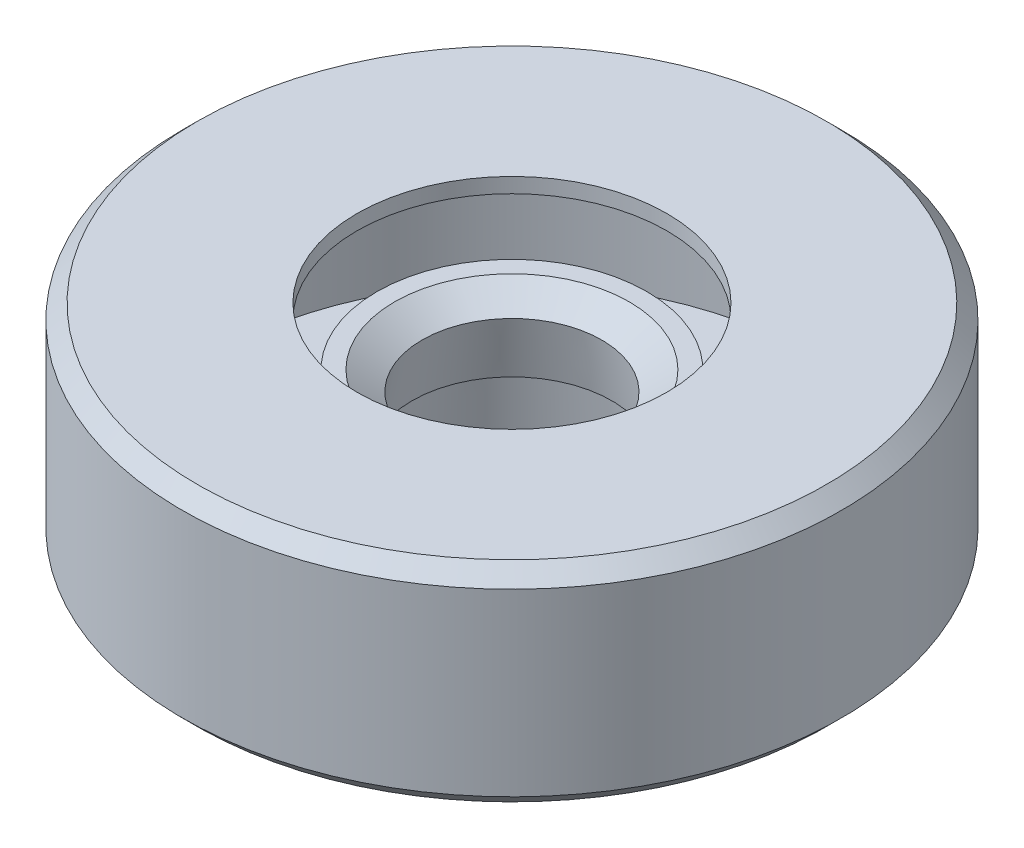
ISO-10303-21;
HEADER;
FILE_DESCRIPTION(('STEP AP214'),'2;1');
FILE_NAME('part.step','',(''),(''),'','','');
FILE_SCHEMA(('AUTOMOTIVE_DESIGN { 1 0 10303 214 1 1 1 1 }'));
ENDSEC;
DATA;
#1=APPLICATION_CONTEXT('core data for automotive mechanical design processes');
#2=APPLICATION_PROTOCOL_DEFINITION('international standard','automotive_design',2000,#1);
#3=PRODUCT_CONTEXT('',#1,'mechanical');
#4=PRODUCT('Part','Part','',(#3));
#5=PRODUCT_RELATED_PRODUCT_CATEGORY('part','',(#4));
#6=PRODUCT_DEFINITION_FORMATION('','',#4);
#7=PRODUCT_DEFINITION_CONTEXT('part definition',#1,'design');
#8=PRODUCT_DEFINITION('design','',#6,#7);
#9=PRODUCT_DEFINITION_SHAPE('','',#8);
#10=(LENGTH_UNIT() NAMED_UNIT(*) SI_UNIT(.MILLI.,.METRE.));
#11=(NAMED_UNIT(*) PLANE_ANGLE_UNIT() SI_UNIT($,.RADIAN.));
#12=(NAMED_UNIT(*) SI_UNIT($,.STERADIAN.) SOLID_ANGLE_UNIT());
#13=UNCERTAINTY_MEASURE_WITH_UNIT(LENGTH_MEASURE(1.E-05),#10,'distance_accuracy_value','');
#14=(GEOMETRIC_REPRESENTATION_CONTEXT(3) GLOBAL_UNCERTAINTY_ASSIGNED_CONTEXT((#13)) GLOBAL_UNIT_ASSIGNED_CONTEXT((#10,
#11,#12)) REPRESENTATION_CONTEXT('',''));
#15=CARTESIAN_POINT('',(0.,0.,0.));
#16=DIRECTION('',(0.,0.,1.));
#17=DIRECTION('',(1.,0.,0.));
#18=AXIS2_PLACEMENT_3D('',#15,#16,#17);
#19=CARTESIAN_POINT('',(0.,2.8999999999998,0.));
#20=DIRECTION('',(0.,-1.,0.));
#21=DIRECTION('',(1.,0.,0.));
#22=AXIS2_PLACEMENT_3D('',#19,#20,#21);
#23=CONICAL_SURFACE('',#22,4.30697363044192,0.087266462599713);
#24=CARTESIAN_POINT('',(0.,1.11237243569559,0.));
#25=DIRECTION('',(0.,1.,0.));
#26=DIRECTION('',(-1.,0.,0.));
#27=AXIS2_PLACEMENT_3D('',#24,#25,#26);
#28=CIRCLE('',#27,4.463370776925);
#29=CARTESIAN_POINT('',(-4.463370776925,1.11237243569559,0.));
#30=VERTEX_POINT('',#29);
#31=EDGE_CURVE('E10',#30,#30,#28,.T.);
#32=ORIENTED_EDGE('',*,*,#31,.T.);
#33=EDGE_LOOP('',(#32));
#34=FACE_BOUND('',#33,.T.);
#35=CARTESIAN_POINT('',(0.,2.8999999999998,0.));
#36=DIRECTION('',(0.,1.,0.));
#37=DIRECTION('',(-1.,0.,0.));
#38=AXIS2_PLACEMENT_3D('',#35,#36,#37);
#39=CIRCLE('',#38,4.30697363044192);
#40=CARTESIAN_POINT('',(-4.30697363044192,2.8999999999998,0.));
#41=VERTEX_POINT('',#40);
#42=EDGE_CURVE('E90',#41,#41,#39,.T.);
#43=ORIENTED_EDGE('',*,*,#42,.F.);
#44=EDGE_LOOP('',(#43));
#45=FACE_BOUND('',#44,.T.);
#46=ADVANCED_FACE('F29',(#34,#45),#23,.T.);
#47=CARTESIAN_POINT('',(-4.463370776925,1.11237243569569,0.));
#48=DIRECTION('',(0.,1.,0.));
#49=DIRECTION('',(-1.,0.,0.));
#50=AXIS2_PLACEMENT_3D('',#47,#48,#49);
#51=PLANE('',#50);
#52=CARTESIAN_POINT('',(0.,1.11237243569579,0.));
#53=DIRECTION('',(0.,1.,0.));
#54=DIRECTION('',(-1.,0.,0.));
#55=AXIS2_PLACEMENT_3D('',#52,#53,#54);
#56=CIRCLE('',#55,5.17047755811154);
#57=CARTESIAN_POINT('',(-5.17047755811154,1.11237243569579,0.));
#58=VERTEX_POINT('',#57);
#59=EDGE_CURVE('E35',#58,#58,#56,.T.);
#60=ORIENTED_EDGE('',*,*,#59,.T.);
#61=EDGE_LOOP('',(#60));
#62=FACE_BOUND('',#61,.T.);
#63=ORIENTED_EDGE('',*,*,#31,.F.);
#64=EDGE_LOOP('',(#63));
#65=FACE_BOUND('',#64,.T.);
#66=ADVANCED_FACE('F98',(#62,#65),#51,.T.);
#67=CARTESIAN_POINT('',(0.,1.11237243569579,0.));
#68=DIRECTION('',(0.,-1.,0.));
#69=DIRECTION('',(1.,0.,0.));
#70=AXIS2_PLACEMENT_3D('',#67,#68,#69);
#71=CONICAL_SURFACE('',#70,5.17047755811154,0.52359877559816);
#72=CARTESIAN_POINT('',(0.,0.499999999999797,0.));
#73=DIRECTION('',(0.,1.,0.));
#74=DIRECTION('',(-1.,0.,0.));
#75=AXIS2_PLACEMENT_3D('',#72,#73,#74);
#76=CIRCLE('',#75,5.52403094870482);
#77=CARTESIAN_POINT('',(-5.52403094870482,0.499999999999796,0.));
#78=VERTEX_POINT('',#77);
#79=EDGE_CURVE('E39',#78,#78,#76,.T.);
#80=ORIENTED_EDGE('',*,*,#79,.T.);
#81=EDGE_LOOP('',(#80));
#82=FACE_BOUND('',#81,.T.);
#83=ORIENTED_EDGE('',*,*,#59,.F.);
#84=EDGE_LOOP('',(#83));
#85=FACE_BOUND('',#84,.T.);
#86=ADVANCED_FACE('F102',(#82,#85),#71,.T.);
#87=CARTESIAN_POINT('',(-10.,0.499999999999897,0.));
#88=DIRECTION('',(0.,1.,0.));
#89=DIRECTION('',(-1.,0.,0.));
#90=AXIS2_PLACEMENT_3D('',#87,#88,#89);
#91=PLANE('',#90);
#92=CARTESIAN_POINT('',(0.,0.5,0.));
#93=DIRECTION('',(0.,1.,0.));
#94=DIRECTION('',(-1.,0.,0.));
#95=AXIS2_PLACEMENT_3D('',#92,#93,#94);
#96=CIRCLE('',#95,10.);
#97=CARTESIAN_POINT('',(-10.,0.499999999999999,0.));
#98=VERTEX_POINT('',#97);
#99=EDGE_CURVE('E43',#98,#98,#96,.T.);
#100=ORIENTED_EDGE('',*,*,#99,.T.);
#101=EDGE_LOOP('',(#100));
#102=FACE_BOUND('',#101,.T.);
#103=ORIENTED_EDGE('',*,*,#79,.F.);
#104=EDGE_LOOP('',(#103));
#105=FACE_BOUND('',#104,.T.);
#106=ADVANCED_FACE('F106',(#102,#105),#91,.T.);
#107=CARTESIAN_POINT('',(0.,5.83619336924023,0.));
#108=DIRECTION('',(0.,1.,0.));
#109=DIRECTION('',(-1.,0.,0.));
#110=AXIS2_PLACEMENT_3D('',#107,#108,#109);
#111=CYLINDRICAL_SURFACE('',#110,10.);
#112=CARTESIAN_POINT('',(0.,6.50000000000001,0.));
#113=DIRECTION('',(0.,1.,0.));
#114=DIRECTION('',(-1.,0.,0.));
#115=AXIS2_PLACEMENT_3D('',#112,#113,#114);
#116=CIRCLE('',#115,10.);
#117=CARTESIAN_POINT('',(-10.,6.50000000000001,0.));
#118=VERTEX_POINT('',#117);
#119=EDGE_CURVE('E48',#118,#118,#116,.T.);
#120=ORIENTED_EDGE('',*,*,#119,.T.);
#121=EDGE_LOOP('',(#120));
#122=FACE_BOUND('',#121,.T.);
#123=ORIENTED_EDGE('',*,*,#99,.F.);
#124=EDGE_LOOP('',(#123));
#125=FACE_BOUND('',#124,.T.);
#126=ADVANCED_FACE('F113',(#122,#125),#111,.F.);
#127=CARTESIAN_POINT('',(-10.,6.5,0.));
#128=DIRECTION('',(0.,-1.,0.));
#129=DIRECTION('',(1.,0.,0.));
#130=AXIS2_PLACEMENT_3D('',#127,#128,#129);
#131=PLANE('',#130);
#132=CARTESIAN_POINT('',(0.,6.5,0.));
#133=DIRECTION('',(0.,1.,0.));
#134=DIRECTION('',(-1.,0.,0.));
#135=AXIS2_PLACEMENT_3D('',#132,#133,#134);
#136=CIRCLE('',#135,5.17047755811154);
#137=CARTESIAN_POINT('',(-5.17047755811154,6.5,0.));
#138=VERTEX_POINT('',#137);
#139=EDGE_CURVE('E51',#138,#138,#136,.T.);
#140=ORIENTED_EDGE('',*,*,#139,.T.);
#141=EDGE_LOOP('',(#140));
#142=FACE_BOUND('',#141,.T.);
#143=ORIENTED_EDGE('',*,*,#119,.F.);
#144=EDGE_LOOP('',(#143));
#145=FACE_BOUND('',#144,.T.);
#146=ADVANCED_FACE('F117',(#142,#145),#131,.T.);
#147=CARTESIAN_POINT('',(0.,5.83619336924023,0.));
#148=DIRECTION('',(0.,1.,0.));
#149=DIRECTION('',(-1.,0.,0.));
#150=AXIS2_PLACEMENT_3D('',#147,#148,#149);
#151=CYLINDRICAL_SURFACE('',#150,5.17047755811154);
#152=CARTESIAN_POINT('',(0.,7.00000000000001,0.));
#153=DIRECTION('',(0.,1.,0.));
#154=DIRECTION('',(-1.,0.,0.));
#155=AXIS2_PLACEMENT_3D('',#152,#153,#154);
#156=CIRCLE('',#155,5.17047755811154);
#157=CARTESIAN_POINT('',(-5.17047755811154,7.00000000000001,0.));
#158=VERTEX_POINT('',#157);
#159=EDGE_CURVE('E54',#158,#158,#156,.T.);
#160=ORIENTED_EDGE('',*,*,#159,.T.);
#161=EDGE_LOOP('',(#160));
#162=FACE_BOUND('',#161,.T.);
#163=ORIENTED_EDGE('',*,*,#139,.F.);
#164=EDGE_LOOP('',(#163));
#165=FACE_BOUND('',#164,.T.);
#166=ADVANCED_FACE('F121',(#162,#165),#151,.F.);
#167=CARTESIAN_POINT('',(-5.17047755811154,7.00000000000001,0.));
#168=DIRECTION('',(0.,1.,0.));
#169=DIRECTION('',(-1.,0.,0.));
#170=AXIS2_PLACEMENT_3D('',#167,#168,#169);
#171=PLANE('',#170);
#172=CARTESIAN_POINT('',(0.,7.00000000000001,0.));
#173=DIRECTION('',(0.,1.,0.));
#174=DIRECTION('',(-1.,0.,0.));
#175=AXIS2_PLACEMENT_3D('',#172,#173,#174);
#176=CIRCLE('',#175,10.5);
#177=CARTESIAN_POINT('',(-10.5,7.00000000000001,0.));
#178=VERTEX_POINT('',#177);
#179=EDGE_CURVE('E57',#178,#178,#176,.T.);
#180=ORIENTED_EDGE('',*,*,#179,.T.);
#181=EDGE_LOOP('',(#180));
#182=FACE_BOUND('',#181,.T.);
#183=ORIENTED_EDGE('',*,*,#159,.F.);
#184=EDGE_LOOP('',(#183));
#185=FACE_BOUND('',#184,.T.);
#186=ADVANCED_FACE('F125',(#182,#185),#171,.T.);
#187=CARTESIAN_POINT('',(0.,7.00000000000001,0.));
#188=DIRECTION('',(0.,-1.,0.));
#189=DIRECTION('',(1.,0.,0.));
#190=AXIS2_PLACEMENT_3D('',#187,#188,#189);
#191=CONICAL_SURFACE('',#190,10.5,0.785398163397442);
#192=CARTESIAN_POINT('',(0.,6.50000000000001,0.));
#193=DIRECTION('',(0.,1.,0.));
#194=DIRECTION('',(-1.,0.,0.));
#195=AXIS2_PLACEMENT_3D('',#192,#193,#194);
#196=CIRCLE('',#195,11.);
#197=CARTESIAN_POINT('',(-11.,6.50000000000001,0.));
#198=VERTEX_POINT('',#197);
#199=EDGE_CURVE('E60',#198,#198,#196,.T.);
#200=ORIENTED_EDGE('',*,*,#199,.T.);
#201=EDGE_LOOP('',(#200));
#202=FACE_BOUND('',#201,.T.);
#203=ORIENTED_EDGE('',*,*,#179,.F.);
#204=EDGE_LOOP('',(#203));
#205=FACE_BOUND('',#204,.T.);
#206=ADVANCED_FACE('F129',(#202,#205),#191,.T.);
#207=CARTESIAN_POINT('',(0.,5.83619336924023,0.));
#208=DIRECTION('',(0.,1.,0.));
#209=DIRECTION('',(-1.,0.,0.));
#210=AXIS2_PLACEMENT_3D('',#207,#208,#209);
#211=CYLINDRICAL_SURFACE('',#210,11.);
#212=CARTESIAN_POINT('',(0.,0.5,0.));
#213=DIRECTION('',(0.,1.,0.));
#214=DIRECTION('',(-1.,0.,0.));
#215=AXIS2_PLACEMENT_3D('',#212,#213,#214);
#216=CIRCLE('',#215,11.);
#217=CARTESIAN_POINT('',(-11.,0.499999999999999,0.));
#218=VERTEX_POINT('',#217);
#219=EDGE_CURVE('E63',#218,#218,#216,.T.);
#220=ORIENTED_EDGE('',*,*,#219,.T.);
#221=EDGE_LOOP('',(#220));
#222=FACE_BOUND('',#221,.T.);
#223=ORIENTED_EDGE('',*,*,#199,.F.);
#224=EDGE_LOOP('',(#223));
#225=FACE_BOUND('',#224,.T.);
#226=ADVANCED_FACE('F133',(#222,#225),#211,.T.);
#227=CARTESIAN_POINT('',(0.,0.5,0.));
#228=DIRECTION('',(0.,1.,0.));
#229=DIRECTION('',(-1.,0.,0.));
#230=AXIS2_PLACEMENT_3D('',#227,#228,#229);
#231=CONICAL_SURFACE('',#230,11.,0.785398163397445);
#232=CARTESIAN_POINT('',(0.,0.,0.));
#233=DIRECTION('',(0.,1.,0.));
#234=DIRECTION('',(-1.,0.,0.));
#235=AXIS2_PLACEMENT_3D('',#232,#233,#234);
#236=CIRCLE('',#235,10.5);
#237=CARTESIAN_POINT('',(-10.5,0.,0.));
#238=VERTEX_POINT('',#237);
#239=EDGE_CURVE('E66',#238,#238,#236,.T.);
#240=ORIENTED_EDGE('',*,*,#239,.T.);
#241=EDGE_LOOP('',(#240));
#242=FACE_BOUND('',#241,.T.);
#243=ORIENTED_EDGE('',*,*,#219,.F.);
#244=EDGE_LOOP('',(#243));
#245=FACE_BOUND('',#244,.T.);
#246=ADVANCED_FACE('F137',(#242,#245),#231,.T.);
#247=CARTESIAN_POINT('',(-10.5,0.,0.));
#248=DIRECTION('',(0.,-1.,0.));
#249=DIRECTION('',(1.,0.,0.));
#250=AXIS2_PLACEMENT_3D('',#247,#248,#249);
#251=PLANE('',#250);
#252=CARTESIAN_POINT('',(0.,0.,0.));
#253=DIRECTION('',(0.,1.,0.));
#254=DIRECTION('',(-1.,0.,0.));
#255=AXIS2_PLACEMENT_3D('',#252,#253,#254);
#256=CIRCLE('',#255,4.05878083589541);
#257=CARTESIAN_POINT('',(-4.05878083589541,0.,0.));
#258=VERTEX_POINT('',#257);
#259=EDGE_CURVE('E69',#258,#258,#256,.T.);
#260=ORIENTED_EDGE('',*,*,#259,.T.);
#261=EDGE_LOOP('',(#260));
#262=FACE_BOUND('',#261,.T.);
#263=ORIENTED_EDGE('',*,*,#239,.F.);
#264=EDGE_LOOP('',(#263));
#265=FACE_BOUND('',#264,.T.);
#266=ADVANCED_FACE('F141',(#262,#265),#251,.T.);
#267=CARTESIAN_POINT('',(0.,0.,0.));
#268=DIRECTION('',(0.,-1.,0.));
#269=DIRECTION('',(1.,0.,0.));
#270=AXIS2_PLACEMENT_3D('',#267,#268,#269);
#271=CONICAL_SURFACE('',#270,4.05878083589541,0.0872664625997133);
#272=CARTESIAN_POINT('',(0.,2.49999999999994,0.));
#273=DIRECTION('',(0.,1.,0.));
#274=DIRECTION('',(-1.,0.,0.));
#275=AXIS2_PLACEMENT_3D('',#272,#273,#274);
#276=CIRCLE('',#275,3.84005917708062);
#277=CARTESIAN_POINT('',(-3.84005917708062,2.49999999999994,0.));
#278=VERTEX_POINT('',#277);
#279=EDGE_CURVE('E72',#278,#278,#276,.T.);
#280=ORIENTED_EDGE('',*,*,#279,.T.);
#281=EDGE_LOOP('',(#280));
#282=FACE_BOUND('',#281,.T.);
#283=ORIENTED_EDGE('',*,*,#259,.F.);
#284=EDGE_LOOP('',(#283));
#285=FACE_BOUND('',#284,.T.);
#286=ADVANCED_FACE('F145',(#282,#285),#271,.F.);
#287=CARTESIAN_POINT('',(-3.34005917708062,2.49999999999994,0.));
#288=DIRECTION('',(0.,-1.,0.));
#289=DIRECTION('',(1.,0.,0.));
#290=AXIS2_PLACEMENT_3D('',#287,#288,#289);
#291=PLANE('',#290);
#292=CARTESIAN_POINT('',(0.,2.49999999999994,0.));
#293=DIRECTION('',(0.,1.,0.));
#294=DIRECTION('',(-1.,0.,0.));
#295=AXIS2_PLACEMENT_3D('',#292,#293,#294);
#296=CIRCLE('',#295,3.34005917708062);
#297=CARTESIAN_POINT('',(-3.34005917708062,2.49999999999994,0.));
#298=VERTEX_POINT('',#297);
#299=EDGE_CURVE('E75',#298,#298,#296,.T.);
#300=ORIENTED_EDGE('',*,*,#299,.T.);
#301=EDGE_LOOP('',(#300));
#302=FACE_BOUND('',#301,.T.);
#303=ORIENTED_EDGE('',*,*,#279,.F.);
#304=EDGE_LOOP('',(#303));
#305=FACE_BOUND('',#304,.T.);
#306=ADVANCED_FACE('F149',(#302,#305),#291,.T.);
#307=CARTESIAN_POINT('',(0.,2.49999999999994,0.));
#308=DIRECTION('',(0.,-1.,0.));
#309=DIRECTION('',(1.,0.,0.));
#310=AXIS2_PLACEMENT_3D('',#307,#308,#309);
#311=CONICAL_SURFACE('',#310,3.34005917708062,0.174532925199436);
#312=CARTESIAN_POINT('',(0.,4.42857142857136,0.));
#313=DIRECTION('',(0.,1.,0.));
#314=DIRECTION('',(-1.,0.,0.));
#315=AXIS2_PLACEMENT_3D('',#312,#313,#314);
#316=CIRCLE('',#315,3.);
#317=CARTESIAN_POINT('',(-3.,4.42857142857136,0.));
#318=VERTEX_POINT('',#317);
#319=EDGE_CURVE('E78',#318,#318,#316,.T.);
#320=ORIENTED_EDGE('',*,*,#319,.T.);
#321=EDGE_LOOP('',(#320));
#322=FACE_BOUND('',#321,.T.);
#323=ORIENTED_EDGE('',*,*,#299,.F.);
#324=EDGE_LOOP('',(#323));
#325=FACE_BOUND('',#324,.T.);
#326=ADVANCED_FACE('F153',(#322,#325),#311,.F.);
#327=CARTESIAN_POINT('',(0.,4.42857142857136,0.));
#328=DIRECTION('',(0.,1.,0.));
#329=DIRECTION('',(-1.,0.,0.));
#330=AXIS2_PLACEMENT_3D('',#327,#328,#329);
#331=CONICAL_SURFACE('',#330,3.,0.95993108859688);
#332=CARTESIAN_POINT('',(0.,5.07142857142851,0.));
#333=DIRECTION('',(0.,1.,0.));
#334=DIRECTION('',(-1.,0.,0.));
#335=AXIS2_PLACEMENT_3D('',#332,#333,#334);
#336=CIRCLE('',#335,3.91809514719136);
#337=CARTESIAN_POINT('',(-3.91809514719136,5.07142857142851,0.));
#338=VERTEX_POINT('',#337);
#339=EDGE_CURVE('E81',#338,#338,#336,.T.);
#340=ORIENTED_EDGE('',*,*,#339,.T.);
#341=EDGE_LOOP('',(#340));
#342=FACE_BOUND('',#341,.T.);
#343=ORIENTED_EDGE('',*,*,#319,.F.);
#344=EDGE_LOOP('',(#343));
#345=FACE_BOUND('',#344,.T.);
#346=ADVANCED_FACE('F157',(#342,#345),#331,.F.);
#347=CARTESIAN_POINT('',(-3.91809514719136,5.07142857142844,0.));
#348=DIRECTION('',(0.,1.,0.));
#349=DIRECTION('',(-1.,0.,0.));
#350=AXIS2_PLACEMENT_3D('',#347,#348,#349);
#351=PLANE('',#350);
#352=CARTESIAN_POINT('',(0.,5.07142857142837,0.));
#353=DIRECTION('',(0.,1.,0.));
#354=DIRECTION('',(-1.,0.,0.));
#355=AXIS2_PLACEMENT_3D('',#352,#353,#354);
#356=CIRCLE('',#355,4.50697363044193);
#357=CARTESIAN_POINT('',(-4.50697363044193,5.07142857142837,0.));
#358=VERTEX_POINT('',#357);
#359=EDGE_CURVE('E84',#358,#358,#356,.T.);
#360=ORIENTED_EDGE('',*,*,#359,.T.);
#361=EDGE_LOOP('',(#360));
#362=FACE_BOUND('',#361,.T.);
#363=ORIENTED_EDGE('',*,*,#339,.F.);
#364=EDGE_LOOP('',(#363));
#365=FACE_BOUND('',#364,.T.);
#366=ADVANCED_FACE('F161',(#362,#365),#351,.T.);
#367=CARTESIAN_POINT('',(0.,5.83619336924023,0.));
#368=DIRECTION('',(0.,1.,0.));
#369=DIRECTION('',(-1.,0.,0.));
#370=AXIS2_PLACEMENT_3D('',#367,#368,#369);
#371=CYLINDRICAL_SURFACE('',#370,4.50697363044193);
#372=CARTESIAN_POINT('',(0.,3.74721359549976,0.));
#373=DIRECTION('',(0.,1.,0.));
#374=DIRECTION('',(-1.,0.,0.));
#375=AXIS2_PLACEMENT_3D('',#372,#373,#374);
#376=CIRCLE('',#375,4.50697363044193);
#377=CARTESIAN_POINT('',(-4.50697363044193,3.74721359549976,0.));
#378=VERTEX_POINT('',#377);
#379=EDGE_CURVE('E87',#378,#378,#376,.T.);
#380=ORIENTED_EDGE('',*,*,#379,.T.);
#381=EDGE_LOOP('',(#380));
#382=FACE_BOUND('',#381,.T.);
#383=ORIENTED_EDGE('',*,*,#359,.F.);
#384=EDGE_LOOP('',(#383));
#385=FACE_BOUND('',#384,.T.);
#386=ADVANCED_FACE('F165',(#382,#385),#371,.T.);
#387=CARTESIAN_POINT('',(0.,3.34721359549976,0.));
#388=DIRECTION('',(0.,1.,0.));
#389=DIRECTION('',(-1.,0.,0.));
#390=AXIS2_PLACEMENT_3D('',#387,#388,#389);
#391=TOROIDAL_SURFACE('',#390,4.30697363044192,0.447213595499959);
#392=ORIENTED_EDGE('',*,*,#42,.T.);
#393=EDGE_LOOP('',(#392));
#394=FACE_BOUND('',#393,.T.);
#395=ORIENTED_EDGE('',*,*,#379,.F.);
#396=EDGE_LOOP('',(#395));
#397=FACE_BOUND('',#396,.T.);
#398=ADVANCED_FACE('F94',(#394,#397),#391,.T.);
#399=CLOSED_SHELL('',(#46,#66,#86,#106,#126,#146,#166,#186,#206,#226,#246,#266,#286,#306,#326,
#346,#366,#386,#398));
#400=MANIFOLD_SOLID_BREP('B2',#399);
#401=ADVANCED_BREP_SHAPE_REPRESENTATION('',(#18,#400),#14);
#402=SHAPE_DEFINITION_REPRESENTATION(#9,#401);
ENDSEC;
END-ISO-10303-21;
